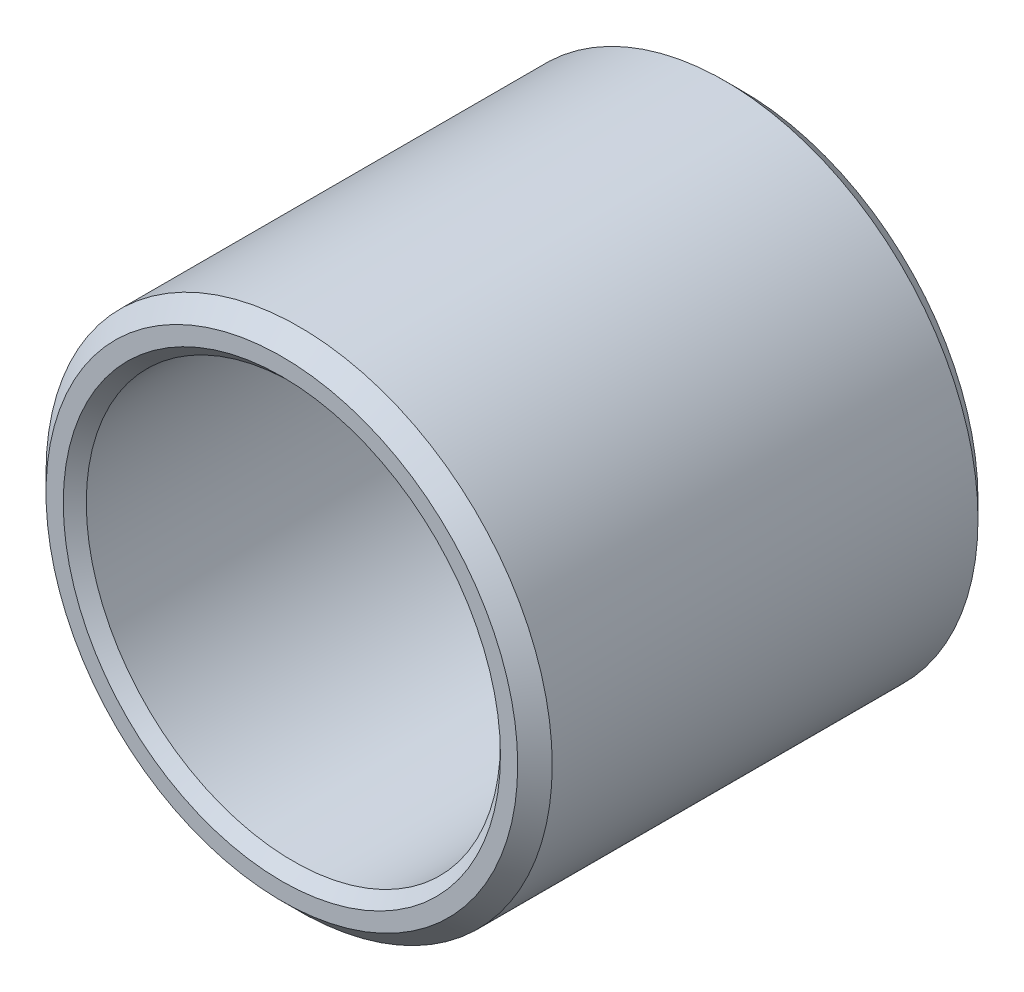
from build123d import *

# Parameters (mm, degrees)
SKETCH1_W     = 31.75
SKETCH1_H     = 3.175
CHAMFER1_SIZE = 0.79375
CHAMFER2_SIZE = 1.190625


with BuildPart() as part:
    # Sketch1 → Revolve1 (revolve)
    with BuildSketch(Plane(origin=(0, 0, 0), x_dir=(0, 0, -1), z_dir=(1, 0, 0)), mode=Mode.PRIVATE) as revolve1_sk:
        with Locations((15.875, 15.871825)):
            Rectangle(SKETCH1_W, SKETCH1_H)
    revolve(revolve1_sk.sketch.rotate(Axis((0, 0, 0), (0, 0, 1)), 90), axis=Axis((0, 0, 0), (0, 0, 1)))

    # Chamfer1
    chamfer1_edges = [part.edges().sort_by_distance(p)[0] for p in [
        (14.284325, 0, 0),
        (14.284325, 0, -31.75),
    ]]
    chamfer(chamfer1_edges, length=CHAMFER1_SIZE)

    # Chamfer2
    chamfer2_edges = [part.edges().sort_by_distance(p)[0] for p in [
        (17.459325, 0, -31.75),
        (17.459325, 0, 0),
    ]]
    chamfer(chamfer2_edges, length=CHAMFER2_SIZE)


solid = part.part
